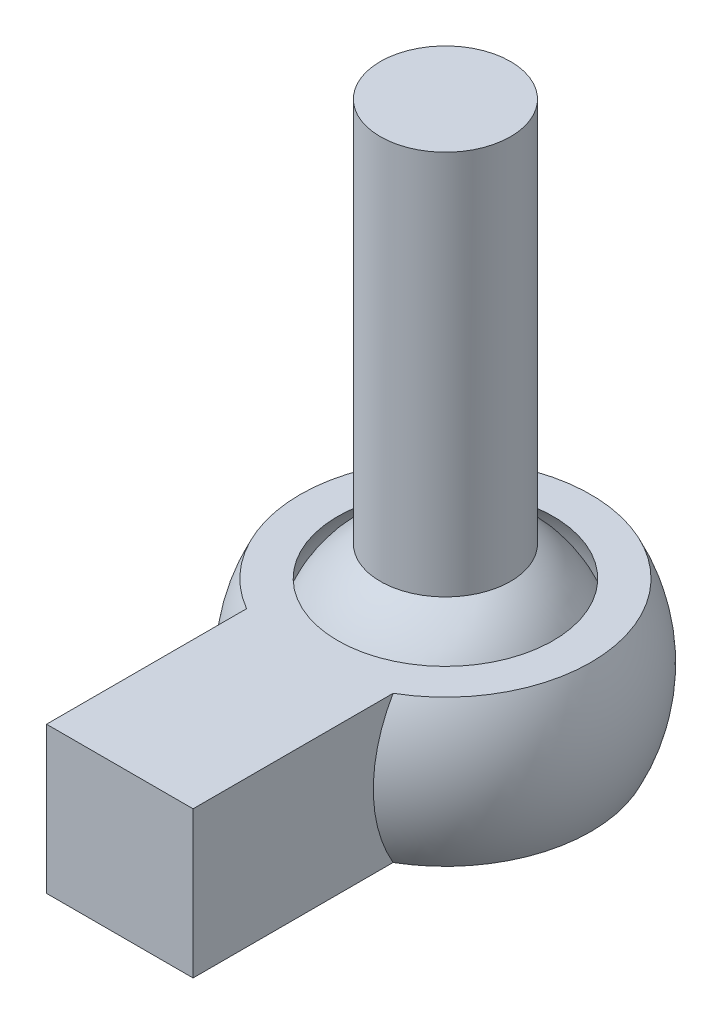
from build123d import *

# Parameters (mm, degrees)
SKETCH3_R                = 4
BOSS_EXTRUDE1_DEPTH      = 30
BOSS_EXTRUDE3_REACH      = 65.166
BOSS_EXTRUDE3_END_RADIUS = 10
BOSS_EXTRUDE3_START      = 30
SKETCH4_W                = 9
SKETCH4_H                = 9
SKETCH5_W                = 10
SKETCH5_H                = 9
CUT_EXTRUDE1_DEPTH       = 45.83581158


with BuildPart() as part:
    # Sketch1 → Revolve2 (revolve)
    with BuildSketch(Plane(origin=(0, 0, 0), x_dir=(0, 0, -1), z_dir=(1, 0, 0))):
        with BuildLine():
            Line((-6.614378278, 4.5), (-8.93028555, 4.5))
            ThreePointArc((-8.93028555, 4.5), (-10, 0), (-8.93028555, -4.5))
            Line((-8.93028555, -4.5), (-6.614378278, -4.5))
            ThreePointArc((-6.614378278, -4.5), (-8, 0), (-6.614378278, 4.5))
        make_face()
    revolve(axis=Axis((0, 0, 0), (0, 1, 0)))

    # Boss-Extrude3: up to this sphere (the profile starts outside it)
    boss_extrude3_end = Location((0, 0, 0)) * Sphere(BOSS_EXTRUDE3_END_RADIUS, mode=Mode.PRIVATE)
    # Sketch4 → Boss-Extrude3 (add, up to the surface)
    with BuildSketch(Plane.XY.offset(BOSS_EXTRUDE3_START), mode=Mode.PRIVATE) as boss_extrude3_sk1:
        Rectangle(SKETCH4_W, SKETCH4_H)
    boss_extrude3_tool1 = extrude(boss_extrude3_sk1.sketch, amount=-BOSS_EXTRUDE3_REACH, mode=Mode.PRIVATE) - boss_extrude3_end
    add(boss_extrude3_tool1.solids().sort_by_distance((0, 0, 30))[0])

    # Sketch5 → Cut-Extrude1 (cut, through all)
    with BuildSketch(Plane(origin=(4.5, 0, 0), x_dir=(0, 0, -1), z_dir=(1, 0, 0))):
        with Locations((-25, 0)):
            Rectangle(SKETCH5_W, SKETCH5_H)
    extrude(amount=-CUT_EXTRUDE1_DEPTH, mode=Mode.SUBTRACT)


with BuildPart() as body_2:
    # Sketch2 → Revolve3 (revolve)
    with BuildSketch(Plane.XY):
        with BuildLine():
            Line((0, -7.5), (0, 7.5))
            ThreePointArc((0, 7.5), (7.5, 0), (0, -7.5))
        make_face()
    revolve(axis=Axis((0, -7.5, 0), (0, 1, 0)))

    # Sketch3 → Boss-Extrude1 (add)
    with BuildSketch(Plane(origin=(0, 0, 0), x_dir=(1, 0, 0), z_dir=(0, 1, 0))):
        with Locations(Location((0, 0, 0), (0, 0, 90))):
            Circle(SKETCH3_R)
    extrude(amount=BOSS_EXTRUDE1_DEPTH)


solid = Compound([part.part, body_2.part])
